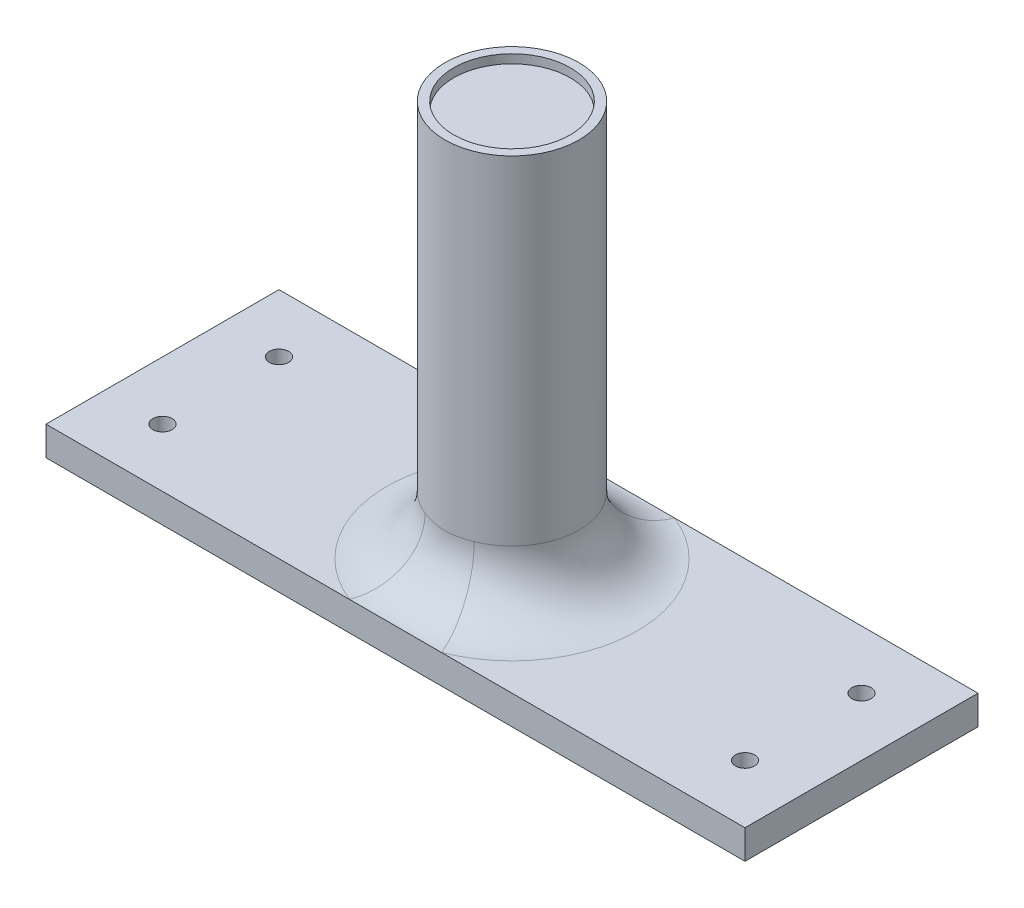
from build123d import *

# Parameters (mm, degrees)
CROQUIS1_W              = 120
CROQUIS1_H              = 40
CROQUIS1_R              = 1.65
SALIENTE_EXTRUIR1_DEPTH = 5
CROQUIS2_R              = 11.5
SALIENTE_EXTRUIR2_DEPTH = 68
REDONDEO1_R             = 10
CROQUIS3_R              = 10
CORTAR_EXTRUIR1_DEPTH   = 1.5


with BuildPart() as part:
    # Croquis1 → Saliente-Extruir1 (new body)
    with BuildSketch(Plane(origin=(0, 0, 0), x_dir=(1, 0, 0), z_dir=(0, 1, 0))):
        Rectangle(CROQUIS1_W, CROQUIS1_H)
        with Locations(Location((-50, 10, 0), (0, 0, 270))):
            Circle(CROQUIS1_R, mode=Mode.SUBTRACT)
        with Locations(Location((50, 10, 0), (0, 0, 270))):
            Circle(CROQUIS1_R, mode=Mode.SUBTRACT)
        with Locations(Location((50, -10, 0), (0, 0, 270))):
            Circle(CROQUIS1_R, mode=Mode.SUBTRACT)
        with Locations(Location((-50, -10, 0), (0, 0, 270))):
            Circle(CROQUIS1_R, mode=Mode.SUBTRACT)
    extrude(amount=SALIENTE_EXTRUIR1_DEPTH)

    # Croquis2 → Saliente-Extruir2 (add)
    with BuildSketch(Plane(origin=(0, 5, 0), x_dir=(1, 0, 0), z_dir=(0, 1, 0))):
        with Locations(Location((0, 0, 0), (0, 0, 270))):
            Circle(CROQUIS2_R)
    extrude(amount=SALIENTE_EXTRUIR2_DEPTH)

    # Redondeo1
    redondeo1_edges = [part.edges().sort_by_distance(p)[0] for p in [
        (0, 5, -11.5),
    ]]
    fillet(redondeo1_edges, radius=REDONDEO1_R)

    # Croquis3 → Cortar-Extruir1 (cut)
    with BuildSketch(Plane(origin=(0, 73, 0), x_dir=(1, 0, 0), z_dir=(0, 1, 0))):
        with Locations(Location((0, 0, 0), (0, 0, 270))):
            Circle(CROQUIS3_R)
    extrude(amount=-CORTAR_EXTRUIR1_DEPTH, mode=Mode.SUBTRACT)


solid = part.part
